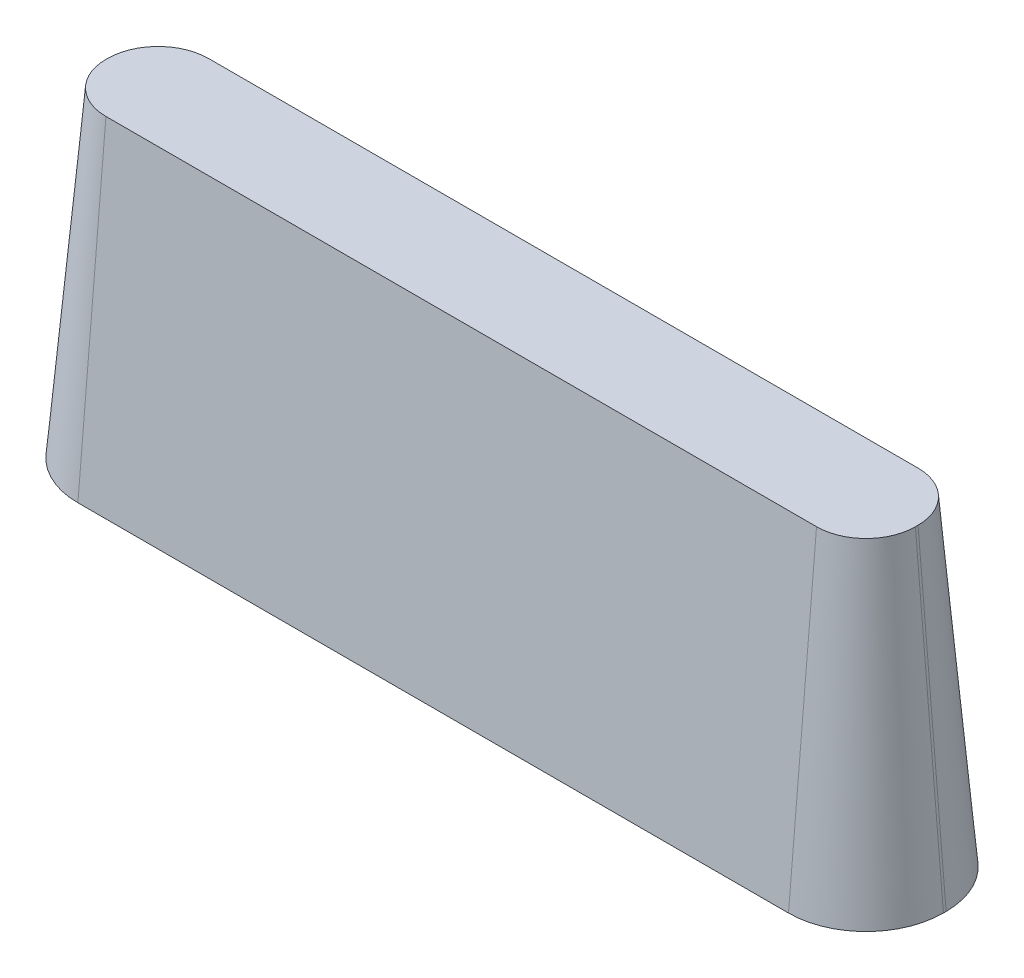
from build123d import *

# Parameters (mm, degrees)
EXTRUDE1_DEPTH     = 609.6
EXTRUDE1_TAPER     = 5
CUT_EXTRUDE1_DEPTH = 604.52
CUT_EXTRUDE1_DRAFT = -5


with BuildPart() as part:
    # Sketch1 → Extrude1 (new body)
    with BuildSketch(Plane(origin=(0, 0, 0), x_dir=(1, 0, 0), z_dir=(0, 1, 0))):
        with BuildLine():
            Line((-70.45023698, 292.536387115), (-70.45023698, 289.996387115))
            ThreePointArc((-70.45023698, 289.996387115), (-27.301207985, 185.825416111), (76.86976302, 142.676387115))
            Line((76.86976302, 142.676387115), (1428.14976302, 142.676387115))
            ThreePointArc((1428.14976302, 142.676387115), (1532.320734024, 185.825416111), (1575.46976302, 289.996387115))
            Line((1575.46976302, 289.996387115), (1575.46976302, 295.076387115))
            ThreePointArc((1575.46976302, 295.076387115), (1532.320734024, 399.247358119), (1428.14976302, 442.396387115))
            Line((1428.14976302, 442.396387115), (79.40976302, 442.396387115))
            ThreePointArc((79.40976302, 442.396387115), (-26.557259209, 398.503409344), (-70.45023698, 292.536387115))
        make_face()
    extrude(amount=EXTRUDE1_DEPTH, taper=EXTRUDE1_TAPER)


with BuildPart() as cut_extrude1_tool:
    # Sketch2 → Cut-Extrude1 (with draft: the straight prism first)
    with BuildSketch(Plane.XZ.offset(-2.54)):
        with BuildLine():
            Line((79.40976302, -439.856387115), (1428.14976302, -439.856387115))
            ThreePointArc((1428.14976302, -439.856387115), (1530.5246828, -397.451306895), (1572.92976302, -295.076387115))
            Line((1572.92976302, -295.076387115), (1572.92976302, -289.996387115))
            ThreePointArc((1572.92976302, -289.996387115), (1530.5246828, -187.621467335), (1428.14976302, -145.216387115))
            Line((1428.14976302, -145.216387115), (76.86976302, -145.216387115))
            ThreePointArc((76.86976302, -145.216387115), (-25.50515676, -187.621467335), (-67.91023698, -289.996387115))
            Line((-67.91023698, -289.996387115), (-67.91023698, -292.536387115))
            ThreePointArc((-67.91023698, -292.536387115), (-24.761207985, -396.707358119), (79.40976302, -439.856387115))
        make_face()
    extrude(amount=-CUT_EXTRUDE1_DEPTH)
    # Cut-Extrude1: the draft: its side faces are tilted about the plane it starts from
    cut_extrude1_sides = [cut_extrude1_tool.faces().sort_by_distance(p)[0] for p in [
        (753.77976302, 304.8, -439.856387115),
        (1530.5246828, 304.8, -397.451306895),
        (1572.92976302, 304.8, -292.536387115),
        (1530.5246828, 304.8, -187.621467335),
        (752.50976302, 304.8, -145.216387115),
        (-25.50515676, 304.8, -187.621467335),
        (-67.91023698, 304.8, -291.266387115),
        (-24.761207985, 304.8, -396.707358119),
    ]]
    draft(cut_extrude1_sides, Plane.XZ.offset(-2.54), CUT_EXTRUDE1_DRAFT)


with BuildPart() as part_1:
    add(part.part)

    # Cut-Extrude1: cut by cut_extrude1_tool
    add(cut_extrude1_tool.part, mode=Mode.SUBTRACT)


solid = part_1.part
